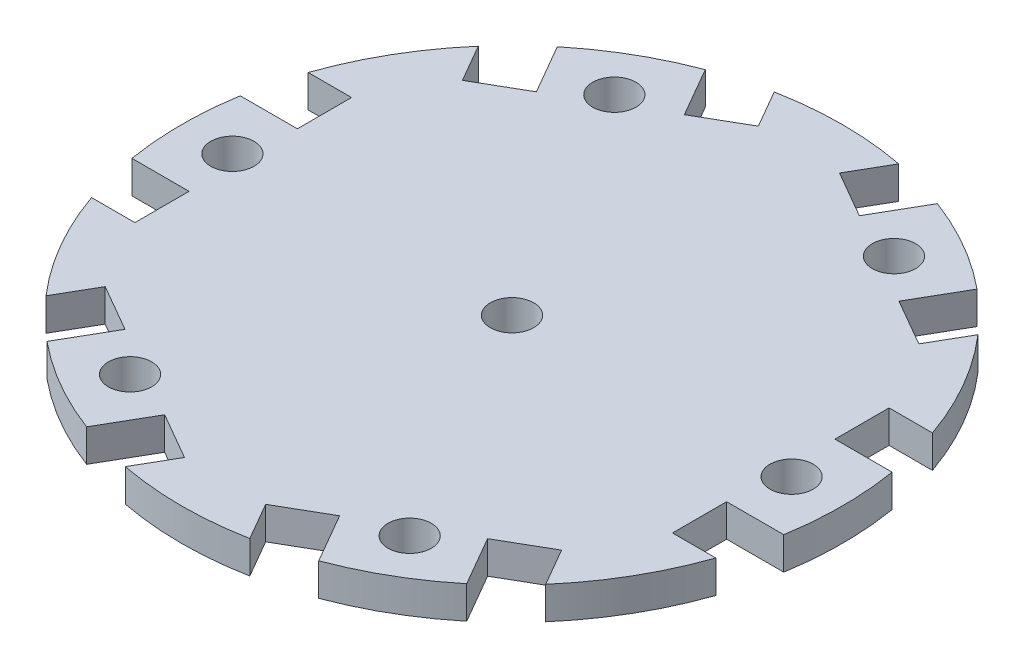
from build123d import *

# Parameters (mm, degrees)
CROQUIS1_R              = 30.5
SALIENTE_EXTRUIR1_DEPTH = 3
CROQUIS2_R              = 2
CORTAR_EXTRUIR1_DEPTH   = 4
CORTAR_EXTRUIR3_START   = -4
CORTAR_EXTRUIR3_DEPTH   = 4
CORTAR_EXTRUIR4_DEPTH   = 10


with BuildPart() as part:
    # Croquis1 → Saliente-Extruir1 (new body)
    with BuildSketch(Plane(origin=(0, 0, 0), x_dir=(1, 0, 0), z_dir=(0, 1, 0))):
        with Locations(Location((0, 0, 0), (0, 0, 270))):
            Circle(CROQUIS1_R)
    extrude(amount=SALIENTE_EXTRUIR1_DEPTH)

    # Croquis2 → Cortar-Extruir1 (cut)
    with BuildSketch(Plane(origin=(0, 3, 0), x_dir=(1, 0, 0), z_dir=(0, 1, 0))):
        with Locations(Location((0, 0, 0), (0, 0, 270))):
            Circle(CROQUIS2_R)
    extrude(amount=-CORTAR_EXTRUIR1_DEPTH, mode=Mode.SUBTRACT)

    # Croquis5 → Cortar-Extruir3 (cut)
    with BuildSketch(Plane(origin=(0, 3, 0), x_dir=(1, 0, 0), z_dir=(0, 1, 0)).offset(CORTAR_EXTRUIR3_START)):
        with BuildLine():
            ThreePointArc((-28.814059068, 10), (-29.556634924, 7.526973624), (-30.087372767, 5))
            Line((-30.087372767, 5), (-28.814059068, 5))
            Line((-28.814059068, 5), (-24.814059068, 5))
            Line((-24.814059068, 5), (-24.814059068, 10))
            Line((-24.814059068, 10), (-28.814059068, 10))
        make_face()
        with BuildLine():
            Line((28.814059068, 5), (30.087372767, 5))
            ThreePointArc((30.087372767, 5), (29.556634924, 7.526973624), (28.814059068, 10))
            Line((28.814059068, 10), (24.814059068, 10))
            Line((24.814059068, 10), (24.814059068, 5))
            Line((24.814059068, 5), (28.814059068, 5))
        make_face()
        with BuildLine():
            Line((30.087372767, -5), (28.814059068, -5))
            Line((28.814059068, -5), (24.814059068, -5))
            Line((24.814059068, -5), (24.814059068, -10))
            Line((24.814059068, -10), (28.814059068, -10))
            ThreePointArc((28.814059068, -10), (29.556634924, -7.526973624), (30.087372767, -5))
        make_face()
        with BuildLine():
            ThreePointArc((19.373813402, -23.556429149), (21.296867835, -21.833309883), (23.067283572, -19.953707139))
            Line((23.067283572, -19.953707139), (21.067283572, -16.489605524))
            Line((21.067283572, -16.489605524), (16.737156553, -18.989605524))
            Line((16.737156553, -18.989605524), (18.737156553, -22.453707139))
            Line((18.737156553, -22.453707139), (19.373813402, -23.556429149))
        make_face()
        with BuildLine():
            ThreePointArc((5.746775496, -29.953707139), (8.25976709, -29.360283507), (10.713559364, -28.556429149))
            Line((10.713559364, -28.556429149), (10.076902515, -27.453707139))
            Line((10.076902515, -27.453707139), (8.076902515, -23.989605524))
            Line((8.076902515, -23.989605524), (3.746775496, -26.489605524))
            Line((3.746775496, -26.489605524), (5.746775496, -29.953707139))
        make_face()
        with BuildLine():
            ThreePointArc((-10.713559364, -28.556429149), (-8.25976709, -29.360283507), (-5.746775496, -29.953707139))
            Line((-5.746775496, -29.953707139), (-3.746775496, -26.489605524))
            Line((-3.746775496, -26.489605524), (-8.076902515, -23.989605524))
            Line((-8.076902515, -23.989605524), (-10.076902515, -27.453707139))
            Line((-10.076902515, -27.453707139), (-10.713559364, -28.556429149))
        make_face()
        with BuildLine():
            ThreePointArc((-23.067283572, -19.953707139), (-21.296867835, -21.833309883), (-19.373813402, -23.556429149))
            Line((-19.373813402, -23.556429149), (-18.737156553, -22.453707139))
            Line((-18.737156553, -22.453707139), (-16.737156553, -18.989605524))
            Line((-16.737156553, -18.989605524), (-21.067283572, -16.489605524))
            Line((-21.067283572, -16.489605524), (-23.067283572, -19.953707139))
        make_face()
        with BuildLine():
            ThreePointArc((-30.087372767, -5), (-29.556634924, -7.526973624), (-28.814059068, -10))
            Line((-28.814059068, -10), (-24.814059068, -10))
            Line((-24.814059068, -10), (-24.814059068, -5))
            Line((-24.814059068, -5), (-28.814059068, -5))
            Line((-28.814059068, -5), (-30.087372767, -5))
        make_face()
        with BuildLine():
            Line((-18.737156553, 22.453707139), (-19.373813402, 23.556429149))
            ThreePointArc((-19.373813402, 23.556429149), (-21.296867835, 21.833309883), (-23.067283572, 19.953707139))
            Line((-23.067283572, 19.953707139), (-21.067283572, 16.489605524))
            Line((-21.067283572, 16.489605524), (-16.737156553, 18.989605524))
            Line((-16.737156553, 18.989605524), (-18.737156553, 22.453707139))
        make_face()
        with BuildLine():
            Line((-3.746775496, 26.489605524), (-5.746775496, 29.953707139))
            ThreePointArc((-5.746775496, 29.953707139), (-8.25976709, 29.360283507), (-10.713559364, 28.556429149))
            Line((-10.713559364, 28.556429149), (-10.076902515, 27.453707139))
            Line((-10.076902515, 27.453707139), (-8.076902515, 23.989605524))
            Line((-8.076902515, 23.989605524), (-3.746775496, 26.489605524))
        make_face()
        with BuildLine():
            Line((10.076902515, 27.453707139), (10.713559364, 28.556429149))
            ThreePointArc((10.713559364, 28.556429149), (8.25976709, 29.360283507), (5.746775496, 29.953707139))
            Line((5.746775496, 29.953707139), (3.746775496, 26.489605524))
            Line((3.746775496, 26.489605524), (8.076902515, 23.989605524))
            Line((8.076902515, 23.989605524), (10.076902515, 27.453707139))
        make_face()
        with BuildLine():
            Line((21.067283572, 16.489605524), (23.067283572, 19.953707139))
            ThreePointArc((23.067283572, 19.953707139), (21.296867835, 21.833309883), (19.373813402, 23.556429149))
            Line((19.373813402, 23.556429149), (18.737156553, 22.453707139))
            Line((18.737156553, 22.453707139), (16.737156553, 18.989605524))
            Line((16.737156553, 18.989605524), (21.067283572, 16.489605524))
        make_face()
    extrude(amount=CORTAR_EXTRUIR3_DEPTH, mode=Mode.SUBTRACT)

    # Croquis7 → Cortar-Extruir4 (cut)
    with BuildSketch(Plane(origin=(0, 3, 0), x_dir=(1, 0, 0), z_dir=(0, 1, 0))):
        with BuildLine():
            ThreePointArc((-13.907029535, 20.623580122), (-11.907029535, 20.623580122), (-10.907029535, 22.355630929))
            Line((-10.907029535, 22.355630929), (-12.907029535, 22.355630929))
            Line((-12.907029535, 22.355630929), (-13.907029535, 20.623580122))
        make_face()
        with BuildLine():
            Line((-12.907029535, 22.355630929), (-10.907029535, 22.355630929))
            ThreePointArc((-10.907029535, 22.355630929), (-13.907029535, 24.087681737), (-13.907029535, 20.623580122))
            Line((-13.907029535, 20.623580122), (-12.907029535, 22.355630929))
        make_face()
        with BuildLine():
            ThreePointArc((-23.81405907, 0), (-24.082008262, 1), (-24.81405907, 1.732050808))
            Line((-24.81405907, 1.732050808), (-25.81405907, 0))
            Line((-25.81405907, 0), (-24.81405907, -1.732050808))
            ThreePointArc((-24.81405907, -1.732050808), (-24.082008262, -1), (-23.81405907, 0))
        make_face()
        with BuildLine():
            Line((-25.81405907, 0), (-24.81405907, 1.732050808))
            ThreePointArc((-24.81405907, 1.732050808), (-27.81405907, 0), (-24.81405907, -1.732050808))
            Line((-24.81405907, -1.732050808), (-25.81405907, 0))
        make_face()
        with BuildLine():
            ThreePointArc((-23.81405907, 0), (-24.082008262, 1), (-24.81405907, 1.732050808))
            Line((-24.81405907, 1.732050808), (-25.81405907, 0))
            Line((-25.81405907, 0), (-24.81405907, -1.732050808))
            ThreePointArc((-24.81405907, -1.732050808), (-24.082008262, -1), (-23.81405907, 0))
        make_face()
        with BuildLine():
            Line((-25.81405907, 0), (-24.81405907, 1.732050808))
            ThreePointArc((-24.81405907, 1.732050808), (-27.81405907, 0), (-24.81405907, -1.732050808))
            Line((-24.81405907, -1.732050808), (-25.81405907, 0))
        make_face()
        with BuildLine():
            ThreePointArc((-13.907029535, 20.623580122), (-11.907029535, 20.623580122), (-10.907029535, 22.355630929))
            Line((-10.907029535, 22.355630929), (-12.907029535, 22.355630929))
            Line((-12.907029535, 22.355630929), (-13.907029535, 20.623580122))
        make_face()
        with BuildLine():
            Line((-12.907029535, 22.355630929), (-10.907029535, 22.355630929))
            ThreePointArc((-10.907029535, 22.355630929), (-13.907029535, 24.087681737), (-13.907029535, 20.623580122))
            Line((-13.907029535, 20.623580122), (-12.907029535, 22.355630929))
        make_face()
        with BuildLine():
            ThreePointArc((10.907029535, 22.355630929), (11.907029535, 20.623580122), (13.907029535, 20.623580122))
            Line((13.907029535, 20.623580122), (12.907029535, 22.355630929))
            Line((12.907029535, 22.355630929), (10.907029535, 22.355630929))
        make_face()
        with BuildLine():
            Line((12.907029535, 22.355630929), (13.907029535, 20.623580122))
            ThreePointArc((13.907029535, 20.623580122), (14.639080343, 21.355630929), (14.907029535, 22.355630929))
            ThreePointArc((14.907029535, 22.355630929), (12.907029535, 24.355630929), (10.907029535, 22.355630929))
            Line((10.907029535, 22.355630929), (12.907029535, 22.355630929))
        make_face()
        with BuildLine():
            ThreePointArc((10.907029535, 22.355630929), (11.907029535, 20.623580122), (13.907029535, 20.623580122))
            Line((13.907029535, 20.623580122), (12.907029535, 22.355630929))
            Line((12.907029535, 22.355630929), (10.907029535, 22.355630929))
        make_face()
        with BuildLine():
            Line((12.907029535, 22.355630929), (13.907029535, 20.623580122))
            ThreePointArc((13.907029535, 20.623580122), (14.639080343, 21.355630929), (14.907029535, 22.355630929))
            ThreePointArc((14.907029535, 22.355630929), (12.907029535, 24.355630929), (10.907029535, 22.355630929))
            Line((10.907029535, 22.355630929), (12.907029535, 22.355630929))
        make_face()
        with BuildLine():
            Line((24.81405907, -1.732050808), (25.81405907, 0))
            Line((25.81405907, 0), (24.81405907, 1.732050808))
            ThreePointArc((24.81405907, 1.732050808), (23.81405907, 0), (24.81405907, -1.732050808))
        make_face()
        with BuildLine():
            Line((24.81405907, 1.732050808), (25.81405907, 0))
            Line((25.81405907, 0), (24.81405907, -1.732050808))
            ThreePointArc((24.81405907, -1.732050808), (26.81405907, -1.732050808), (27.81405907, 0))
            ThreePointArc((27.81405907, 0), (26.81405907, 1.732050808), (24.81405907, 1.732050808))
        make_face()
        with BuildLine():
            Line((24.81405907, -1.732050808), (25.81405907, 0))
            Line((25.81405907, 0), (24.81405907, 1.732050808))
            ThreePointArc((24.81405907, 1.732050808), (23.81405907, 0), (24.81405907, -1.732050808))
        make_face()
        with BuildLine():
            Line((24.81405907, 1.732050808), (25.81405907, 0))
            Line((25.81405907, 0), (24.81405907, -1.732050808))
            ThreePointArc((24.81405907, -1.732050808), (26.81405907, -1.732050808), (27.81405907, 0))
            ThreePointArc((27.81405907, 0), (26.81405907, 1.732050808), (24.81405907, 1.732050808))
        make_face()
        with BuildLine():
            ThreePointArc((-13.907029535, -20.623580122), (-13.907029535, -24.087681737), (-10.907029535, -22.355630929))
            Line((-10.907029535, -22.355630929), (-12.907029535, -22.355630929))
            Line((-12.907029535, -22.355630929), (-13.907029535, -20.623580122))
        make_face()
        with BuildLine():
            Line((-12.907029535, -22.355630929), (-10.907029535, -22.355630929))
            ThreePointArc((-10.907029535, -22.355630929), (-11.907029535, -20.623580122), (-13.907029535, -20.623580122))
            Line((-13.907029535, -20.623580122), (-12.907029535, -22.355630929))
        make_face()
        with BuildLine():
            ThreePointArc((-13.907029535, -20.623580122), (-13.907029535, -24.087681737), (-10.907029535, -22.355630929))
            Line((-10.907029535, -22.355630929), (-12.907029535, -22.355630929))
            Line((-12.907029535, -22.355630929), (-13.907029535, -20.623580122))
        make_face()
        with BuildLine():
            Line((-12.907029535, -22.355630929), (-10.907029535, -22.355630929))
            ThreePointArc((-10.907029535, -22.355630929), (-11.907029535, -20.623580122), (-13.907029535, -20.623580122))
            Line((-13.907029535, -20.623580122), (-12.907029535, -22.355630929))
        make_face()
        with BuildLine():
            ThreePointArc((14.907029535, -22.355630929), (14.639080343, -21.355630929), (13.907029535, -20.623580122))
            Line((13.907029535, -20.623580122), (12.907029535, -22.355630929))
            Line((12.907029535, -22.355630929), (10.907029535, -22.355630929))
            ThreePointArc((10.907029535, -22.355630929), (12.907029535, -24.355630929), (14.907029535, -22.355630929))
        make_face()
        with BuildLine():
            Line((12.907029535, -22.355630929), (13.907029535, -20.623580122))
            ThreePointArc((13.907029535, -20.623580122), (11.907029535, -20.623580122), (10.907029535, -22.355630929))
            Line((10.907029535, -22.355630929), (12.907029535, -22.355630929))
        make_face()
        with BuildLine():
            ThreePointArc((14.907029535, -22.355630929), (14.639080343, -21.355630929), (13.907029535, -20.623580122))
            Line((13.907029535, -20.623580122), (12.907029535, -22.355630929))
            Line((12.907029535, -22.355630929), (10.907029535, -22.355630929))
            ThreePointArc((10.907029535, -22.355630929), (12.907029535, -24.355630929), (14.907029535, -22.355630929))
        make_face()
        with BuildLine():
            Line((12.907029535, -22.355630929), (13.907029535, -20.623580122))
            ThreePointArc((13.907029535, -20.623580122), (11.907029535, -20.623580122), (10.907029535, -22.355630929))
            Line((10.907029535, -22.355630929), (12.907029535, -22.355630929))
        make_face()
    extrude(amount=-CORTAR_EXTRUIR4_DEPTH, mode=Mode.SUBTRACT)


solid = part.part
